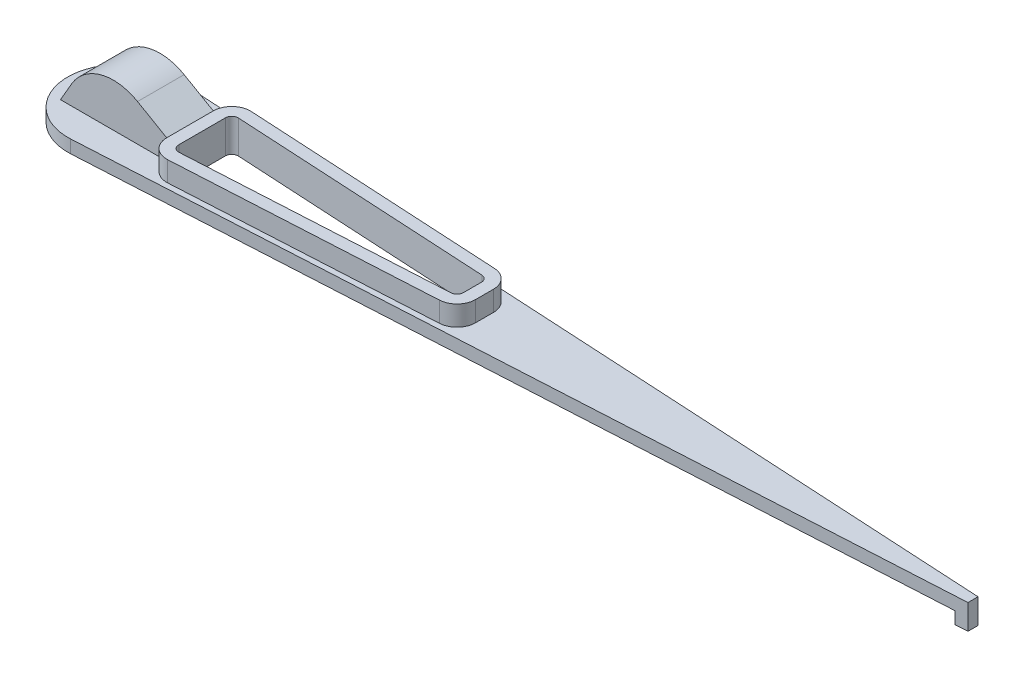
from build123d import *

# Parameters (mm, degrees)
EXTRUDE1_DEPTH      = 1.6
EXTRUDE2_DEPTH      = 2.5
EXTRUDE6_DEPTH      = 107.278219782
EXTRUDE7_DEPTH      = 2.89468
EXTRUDE7_DEPTH_BACK = 2.89468
FILLET1_R           = 6
SKETCH4_R           = 5
EXTRUDE4_DEPTH      = 1
EXTRUDE8_DEPTH      = 1.5


with BuildPart() as part:
    # Sketch1 → Extrude1 (new body)
    with BuildSketch(Plane(origin=(0, 0, 0), x_dir=(1, 0, 0), z_dir=(0, 1, 0))):
        with BuildLine():
            Line((106, 0.625), (106, -0.625))
            Line((106, -0.625), (0.360318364, -6.490005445))
            ThreePointArc((0.360318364, -6.490005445), (-6.5, 0), (0.360318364, 6.490005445))
            Line((0.360318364, 6.490005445), (106, 0.625))
        make_face()
    extrude(amount=EXTRUDE1_DEPTH)

    # Sketch2 → Extrude2 (add)
    with BuildSketch(Plane(origin=(0, 1.6, 0), x_dir=(1, 0, 0), z_dir=(0, 1, 0))):
        with BuildLine():
            Line((8.7, 2.894681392), (8.7, -2.894681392))
            ThreePointArc((8.7, -2.894681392), (9.419374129, -4.56549612), (11.127497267, -5.191144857))
            Line((11.127497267, -5.191144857), (43.127497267, -3.414538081))
            ThreePointArc((43.127497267, -3.414538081), (44.670814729, -2.698700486), (45.3, -1.118074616))
            Line((45.3, -1.118074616), (45.3, 1.118074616))
            ThreePointArc((45.3, 1.118074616), (44.670814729, 2.698700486), (43.127497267, 3.414538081))
            Line((43.127497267, 3.414538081), (11.127497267, 5.191144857))
            ThreePointArc((11.127497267, 5.191144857), (9.419374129, 4.56549612), (8.7, 2.894681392))
        make_face()
    extrude(amount=EXTRUDE2_DEPTH)

    # Sketch5 → Extrude6 (cut, through all)
    with BuildSketch(Plane(origin=(0, 4.1, 0), x_dir=(1, 0, 0), z_dir=(0, 1, 0))):
        with BuildLine():
            Line((10.2, 2.894681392), (10.2, -2.894681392))
            ThreePointArc((10.2, -2.894681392), (10.450217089, -3.475834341), (11.044346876, -3.693451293))
            Line((11.044346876, -3.693451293), (43.044346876, -1.916844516))
            ThreePointArc((43.044346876, -1.916844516), (43.581152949, -1.667857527), (43.8, -1.118074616))
            Line((43.8, -1.118074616), (43.8, 1.118074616))
            ThreePointArc((43.8, 1.118074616), (43.581152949, 1.667857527), (43.044346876, 1.916844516))
            Line((43.044346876, 1.916844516), (11.044346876, 3.693451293))
            ThreePointArc((11.044346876, 3.693451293), (10.450217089, 3.475834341), (10.2, 2.894681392))
        make_face()
    extrude(amount=-EXTRUDE6_DEPTH, mode=Mode.SUBTRACT)

    # Sketch6 → Extrude7 (add, two sides: drawn at the far end of the back side and taken through both)
    with BuildSketch(Plane(origin=(0, 0, 0), x_dir=(1, 0, 0), z_dir=(0, 0, -1)).offset(-EXTRUDE7_DEPTH_BACK)):
        Polygon((-4.5, -1.6), (0.360318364, -1.6), (8.7, -1.6), (8.7, -4.1), (-0.117468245, -9.190767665), align=None)
    extrude(amount=EXTRUDE7_DEPTH + EXTRUDE7_DEPTH_BACK)

    # Fillet1
    fillet1_edges = [part.edges().sort_by_distance(p)[0] for p in [
        (-0.117468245, 9.190767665, 0),
    ]]
    fillet(fillet1_edges, radius=FILLET1_R)

    # Sketch4 → Extrude4 (add)
    with BuildSketch(Plane(origin=(0, 0, 0), x_dir=(-1, 0, 0), z_dir=(0, -1, 0))):
        with Locations(Location((0, 0, 0), (0, 0, 270))):
            Circle(SKETCH4_R)
    extrude(amount=EXTRUDE4_DEPTH)

    # Sketch7 → Extrude8 (add)
    with BuildSketch(Plane(origin=(0, 0, 0), x_dir=(-1, 0, 0), z_dir=(0, -1, 0))):
        Polygon((-104.5, 0.708278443), (-104.5, -0.708278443), (-106, -0.625), (-106, 0.625), align=None)
    extrude(amount=EXTRUDE8_DEPTH)


solid = part.part
